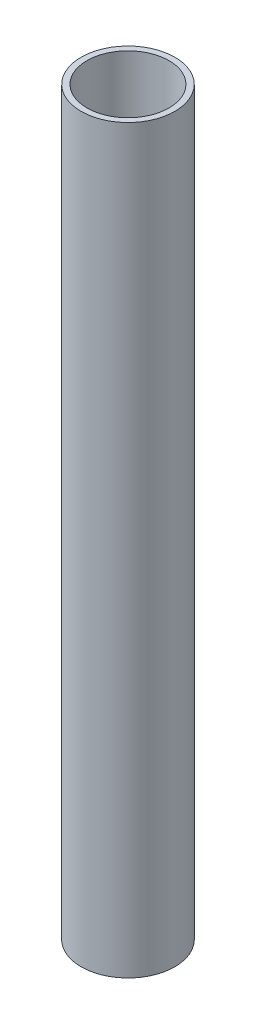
ISO-10303-21;
HEADER;
FILE_DESCRIPTION(('STEP AP214'),'2;1');
FILE_NAME('part.step','',(''),(''),'','','');
FILE_SCHEMA(('AUTOMOTIVE_DESIGN { 1 0 10303 214 1 1 1 1 }'));
ENDSEC;
DATA;
#1=APPLICATION_CONTEXT('core data for automotive mechanical design processes');
#2=APPLICATION_PROTOCOL_DEFINITION('international standard','automotive_design',2000,#1);
#3=PRODUCT_CONTEXT('',#1,'mechanical');
#4=PRODUCT('Part','Part','',(#3));
#5=PRODUCT_RELATED_PRODUCT_CATEGORY('part','',(#4));
#6=PRODUCT_DEFINITION_FORMATION('','',#4);
#7=PRODUCT_DEFINITION_CONTEXT('part definition',#1,'design');
#8=PRODUCT_DEFINITION('design','',#6,#7);
#9=PRODUCT_DEFINITION_SHAPE('','',#8);
#10=(LENGTH_UNIT() NAMED_UNIT(*) SI_UNIT(.MILLI.,.METRE.));
#11=(NAMED_UNIT(*) PLANE_ANGLE_UNIT() SI_UNIT($,.RADIAN.));
#12=(NAMED_UNIT(*) SI_UNIT($,.STERADIAN.) SOLID_ANGLE_UNIT());
#13=UNCERTAINTY_MEASURE_WITH_UNIT(LENGTH_MEASURE(1.E-05),#10,'distance_accuracy_value','');
#14=(GEOMETRIC_REPRESENTATION_CONTEXT(3) GLOBAL_UNCERTAINTY_ASSIGNED_CONTEXT((#13)) GLOBAL_UNIT_ASSIGNED_CONTEXT((#10,
#11,#12)) REPRESENTATION_CONTEXT('',''));
#15=CARTESIAN_POINT('',(0.,0.,0.));
#16=DIRECTION('',(0.,0.,1.));
#17=DIRECTION('',(1.,0.,0.));
#18=AXIS2_PLACEMENT_3D('',#15,#16,#17);
#19=CARTESIAN_POINT('',(0.,100.33,0.));
#20=DIRECTION('',(0.,1.,0.));
#21=DIRECTION('',(0.,0.,1.));
#22=AXIS2_PLACEMENT_3D('',#19,#20,#21);
#23=PLANE('',#22);
#24=CARTESIAN_POINT('',(0.,100.33,0.));
#25=DIRECTION('',(0.,1.,0.));
#26=DIRECTION('',(0.,0.,1.));
#27=AXIS2_PLACEMENT_3D('',#24,#25,#26);
#28=CIRCLE('',#27,6.35);
#29=CARTESIAN_POINT('',(0.,100.33,6.35));
#30=VERTEX_POINT('',#29);
#31=EDGE_CURVE('E10',#30,#30,#28,.T.);
#32=ORIENTED_EDGE('',*,*,#31,.T.);
#33=EDGE_LOOP('',(#32));
#34=FACE_BOUND('',#33,.T.);
#35=CARTESIAN_POINT('',(0.,100.33,0.));
#36=DIRECTION('',(0.,1.,0.));
#37=DIRECTION('',(0.,0.,1.));
#38=AXIS2_PLACEMENT_3D('',#35,#36,#37);
#39=CIRCLE('',#38,5.55625);
#40=CARTESIAN_POINT('',(0.,100.33,5.55625));
#41=VERTEX_POINT('',#40);
#42=EDGE_CURVE('E42',#41,#41,#39,.T.);
#43=ORIENTED_EDGE('',*,*,#42,.F.);
#44=EDGE_LOOP('',(#43));
#45=FACE_BOUND('',#44,.T.);
#46=ADVANCED_FACE('F31',(#34,#45),#23,.T.);
#47=CARTESIAN_POINT('',(0.,0.,0.));
#48=DIRECTION('',(0.,1.,0.));
#49=DIRECTION('',(0.,0.,1.));
#50=AXIS2_PLACEMENT_3D('',#47,#48,#49);
#51=PLANE('',#50);
#52=CARTESIAN_POINT('',(0.,0.,0.));
#53=DIRECTION('',(0.,1.,0.));
#54=DIRECTION('',(0.,0.,1.));
#55=AXIS2_PLACEMENT_3D('',#52,#53,#54);
#56=CIRCLE('',#55,6.35);
#57=CARTESIAN_POINT('',(0.,0.,6.35));
#58=VERTEX_POINT('',#57);
#59=EDGE_CURVE('E35',#58,#58,#56,.T.);
#60=ORIENTED_EDGE('',*,*,#59,.F.);
#61=EDGE_LOOP('',(#60));
#62=FACE_BOUND('',#61,.T.);
#63=CARTESIAN_POINT('',(0.,0.,0.));
#64=DIRECTION('',(0.,1.,0.));
#65=DIRECTION('',(0.,0.,1.));
#66=AXIS2_PLACEMENT_3D('',#63,#64,#65);
#67=CIRCLE('',#66,5.55625);
#68=CARTESIAN_POINT('',(0.,0.,5.55625));
#69=VERTEX_POINT('',#68);
#70=EDGE_CURVE('E44',#69,#69,#67,.T.);
#71=ORIENTED_EDGE('',*,*,#70,.T.);
#72=EDGE_LOOP('',(#71));
#73=FACE_BOUND('',#72,.T.);
#74=ADVANCED_FACE('F54',(#62,#73),#51,.F.);
#75=CARTESIAN_POINT('',(0.,100.33,0.));
#76=DIRECTION('',(0.,-1.,0.));
#77=DIRECTION('',(0.,0.,-1.));
#78=AXIS2_PLACEMENT_3D('',#75,#76,#77);
#79=CYLINDRICAL_SURFACE('',#78,6.35);
#80=ORIENTED_EDGE('',*,*,#31,.F.);
#81=EDGE_LOOP('',(#80));
#82=FACE_BOUND('',#81,.T.);
#83=ORIENTED_EDGE('',*,*,#59,.T.);
#84=EDGE_LOOP('',(#83));
#85=FACE_BOUND('',#84,.T.);
#86=ADVANCED_FACE('F33',(#82,#85),#79,.T.);
#87=CARTESIAN_POINT('',(0.,100.33,0.));
#88=DIRECTION('',(0.,-1.,0.));
#89=DIRECTION('',(0.,0.,-1.));
#90=AXIS2_PLACEMENT_3D('',#87,#88,#89);
#91=CYLINDRICAL_SURFACE('',#90,5.55625);
#92=ORIENTED_EDGE('',*,*,#42,.T.);
#93=EDGE_LOOP('',(#92));
#94=FACE_BOUND('',#93,.T.);
#95=ORIENTED_EDGE('',*,*,#70,.F.);
#96=EDGE_LOOP('',(#95));
#97=FACE_BOUND('',#96,.T.);
#98=ADVANCED_FACE('F50',(#94,#97),#91,.F.);
#99=CLOSED_SHELL('',(#46,#74,#86,#98));
#100=MANIFOLD_SOLID_BREP('B2',#99);
#101=ADVANCED_BREP_SHAPE_REPRESENTATION('',(#18,#100),#14);
#102=SHAPE_DEFINITION_REPRESENTATION(#9,#101);
ENDSEC;
END-ISO-10303-21;
